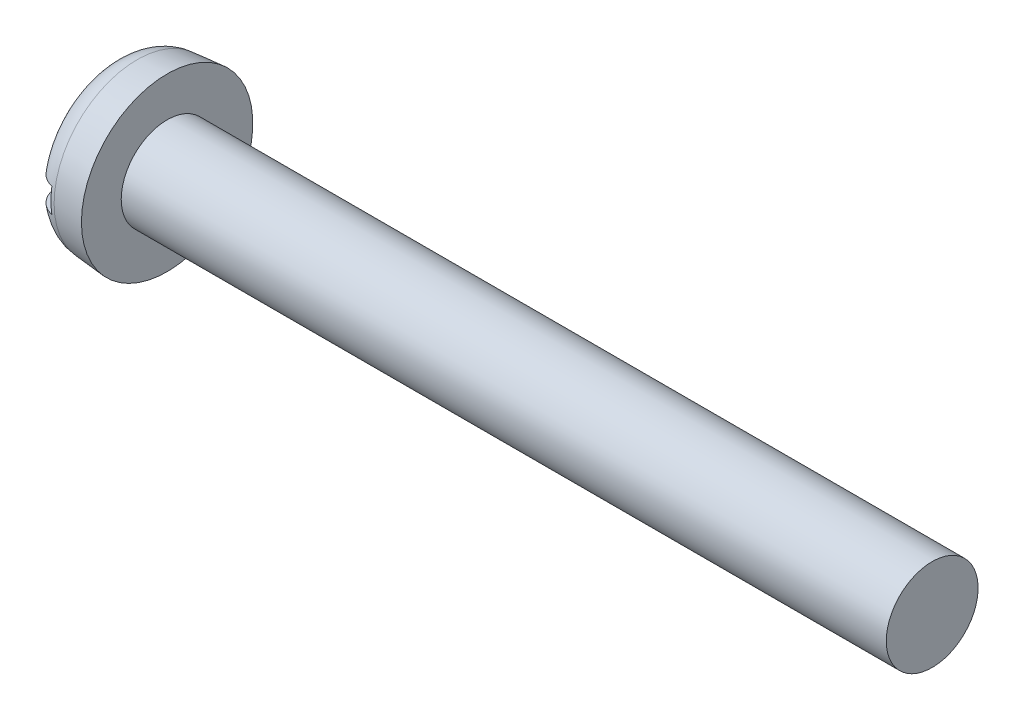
from build123d import *

# Parameters (mm, degrees)
FILLET2_R  = 0.9
SKETCH2_W  = 5.6
SKETCH2_H  = 0.8
SLOT_DEPTH = 0.7


with BuildPart() as part:
    # BodySke → Base-Revolve (revolve)
    with BuildSketch(Plane.XY, mode=Mode.PRIVATE) as base_revolve_sk:
        Polygon((1.8, 1.5), (1.8, 2.8), (0, 2.642520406), (0, 0), (26.8, 0), (26.8, 1.5), align=None)
    revolve(base_revolve_sk.sketch.rotate(Axis((-25.4, 0, 0), (1, 0, 0)), 90), axis=Axis((-25.4, 0, 0), (1, 0, 0)))

    # Fillet2
    fillet2_edges = [part.edges().sort_by_distance(p)[0] for p in [
        (0, 0, -2.642520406),
    ]]
    fillet(fillet2_edges, radius=FILLET2_R)

    # Sketch2 → Slot (cut)
    with BuildSketch(Plane(origin=(0, 0, 0), x_dir=(0, 0, -1), z_dir=(1, 0, 0))):
        Rectangle(SKETCH2_W, SKETCH2_H)
    extrude(amount=SLOT_DEPTH, mode=Mode.SUBTRACT)


solid = part.part
